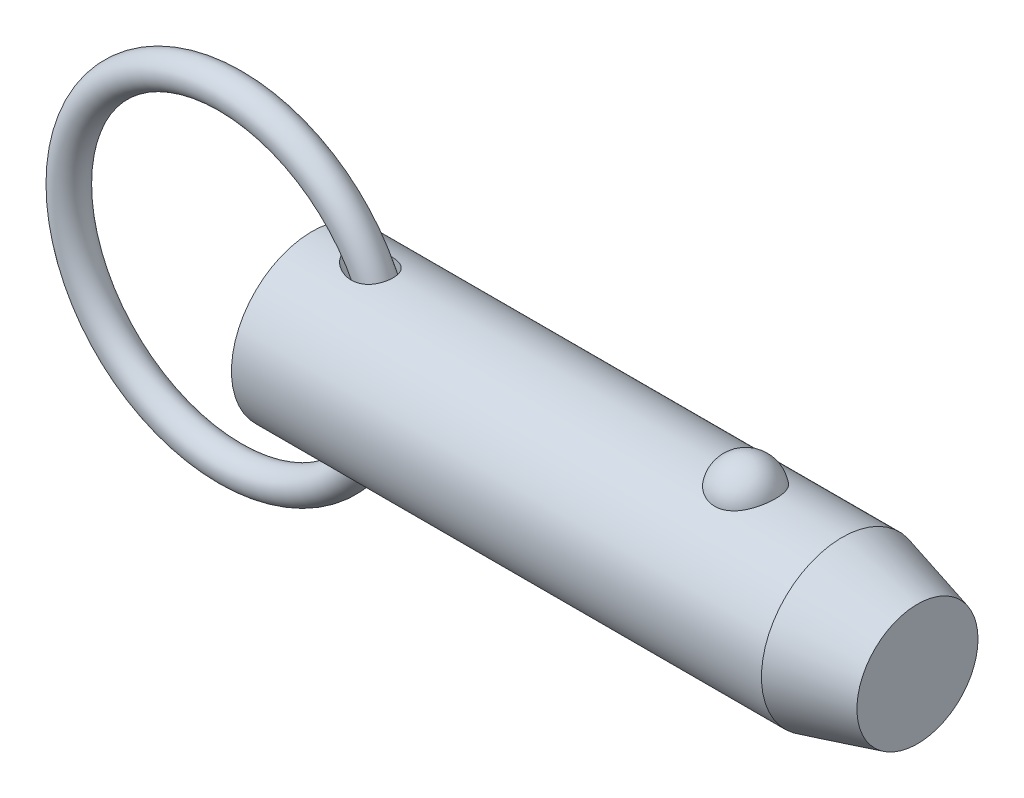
ISO-10303-21;
HEADER;
FILE_DESCRIPTION(('STEP AP214'),'2;1');
FILE_NAME('part.step','',(''),(''),'','','');
FILE_SCHEMA(('AUTOMOTIVE_DESIGN { 1 0 10303 214 1 1 1 1 }'));
ENDSEC;
DATA;
#1=APPLICATION_CONTEXT('core data for automotive mechanical design processes');
#2=APPLICATION_PROTOCOL_DEFINITION('international standard','automotive_design',2000,#1);
#3=PRODUCT_CONTEXT('',#1,'mechanical');
#4=PRODUCT('Part','Part','',(#3));
#5=PRODUCT_RELATED_PRODUCT_CATEGORY('part','',(#4));
#6=PRODUCT_DEFINITION_FORMATION('','',#4);
#7=PRODUCT_DEFINITION_CONTEXT('part definition',#1,'design');
#8=PRODUCT_DEFINITION('design','',#6,#7);
#9=PRODUCT_DEFINITION_SHAPE('','',#8);
#10=(LENGTH_UNIT() NAMED_UNIT(*) SI_UNIT(.MILLI.,.METRE.));
#11=(NAMED_UNIT(*) PLANE_ANGLE_UNIT() SI_UNIT($,.RADIAN.));
#12=(NAMED_UNIT(*) SI_UNIT($,.STERADIAN.) SOLID_ANGLE_UNIT());
#13=UNCERTAINTY_MEASURE_WITH_UNIT(LENGTH_MEASURE(1.E-05),#10,'distance_accuracy_value','');
#14=(GEOMETRIC_REPRESENTATION_CONTEXT(3) GLOBAL_UNCERTAINTY_ASSIGNED_CONTEXT((#13)) GLOBAL_UNIT_ASSIGNED_CONTEXT((#10,
#11,#12)) REPRESENTATION_CONTEXT('',''));
#15=CARTESIAN_POINT('',(0.,0.,0.));
#16=DIRECTION('',(0.,0.,1.));
#17=DIRECTION('',(1.,0.,0.));
#18=AXIS2_PLACEMENT_3D('',#15,#16,#17);
#19=CARTESIAN_POINT('',(-9.66825126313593,0.,0.));
#20=DIRECTION('',(0.,0.,1.));
#21=DIRECTION('',(1.,0.,0.));
#22=AXIS2_PLACEMENT_3D('',#19,#20,#21);
#23=TOROIDAL_SURFACE('',#22,19.05,1.905);
#24=CARTESIAN_POINT('',(11.2867487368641,0.,0.));
#25=VERTEX_POINT('',#24);
#26=VERTEX_LOOP('',#25);
#27=FACE_BOUND('',#26,.T.);
#28=ADVANCED_FACE('P0_F12',(#27),#23,.T.);
#29=CLOSED_SHELL('',(#28));
#30=MANIFOLD_SOLID_BREP('P0_B1',#29);
#31=CARTESIAN_POINT('',(0.,0.,0.));
#32=DIRECTION('',(1.,0.,0.));
#33=DIRECTION('',(0.,0.,-1.));
#34=AXIS2_PLACEMENT_3D('',#31,#32,#33);
#35=CYLINDRICAL_SURFACE('',#34,9.525);
#36=CARTESIAN_POINT('',(4.56693409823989,9.4314194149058,-1.33189820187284));
#37=CARTESIAN_POINT('',(4.70260475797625,9.41020313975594,-1.48215931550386));
#38=CARTESIAN_POINT('',(4.85555680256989,9.38755003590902,-1.61683982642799));
#39=CARTESIAN_POINT('',(5.10171959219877,9.35450554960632,-1.79512943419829));
#40=CARTESIAN_POINT('',(5.18674514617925,9.34362629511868,-1.85068909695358));
#41=CARTESIAN_POINT('',(5.3615438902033,9.32258514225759,-1.95392002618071));
#42=CARTESIAN_POINT('',(5.45131542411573,9.31242299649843,-2.00159402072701));
#43=CARTESIAN_POINT('',(5.70070211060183,9.28632120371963,-2.12033289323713));
#44=CARTESIAN_POINT('',(5.86420408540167,9.27146938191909,-2.18362944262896));
#45=CARTESIAN_POINT('',(6.19893345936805,9.24694163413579,-2.28525783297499));
#46=CARTESIAN_POINT('',(6.3701538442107,9.23726110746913,-2.32361187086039));
#47=CARTESIAN_POINT('',(6.73531776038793,9.22400982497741,-2.37575048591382));
#48=CARTESIAN_POINT('',(6.92975826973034,9.22118808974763,-2.38652934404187));
#49=CARTESIAN_POINT('',(7.21995443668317,9.22416297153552,-2.37494980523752));
#50=CARTESIAN_POINT('',(7.31643847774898,9.22635560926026,-2.366466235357));
#51=CARTESIAN_POINT('',(7.50796421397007,9.2331428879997,-2.33985028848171));
#52=CARTESIAN_POINT('',(7.60300650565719,9.23773650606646,-2.32172202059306));
#53=CARTESIAN_POINT('',(7.83273114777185,9.25183311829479,-2.26504721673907));
#54=CARTESIAN_POINT('',(7.96603028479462,9.26261470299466,-2.2209856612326));
#55=CARTESIAN_POINT('',(8.22310899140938,9.28816519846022,-2.1115730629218));
#56=CARTESIAN_POINT('',(8.34689477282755,9.30293147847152,-2.04623606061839));
#57=CARTESIAN_POINT('',(8.58136049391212,9.3349416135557,-1.89485344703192));
#58=CARTESIAN_POINT('',(8.69199721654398,9.35219324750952,-1.8087422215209));
#59=CARTESIAN_POINT('',(8.89592093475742,9.38707016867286,-1.6179918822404));
#60=CARTESIAN_POINT('',(8.98920771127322,9.40469546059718,-1.51335253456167));
#61=CARTESIAN_POINT('',(9.15057731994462,9.43713590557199,-1.29519427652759));
#62=CARTESIAN_POINT('',(9.21980158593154,9.45205440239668,-1.18253282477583));
#63=CARTESIAN_POINT('',(9.33826736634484,9.47856708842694,-0.946802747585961));
#64=CARTESIAN_POINT('',(9.38751161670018,9.49016173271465,-0.823735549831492));
#65=CARTESIAN_POINT('',(9.46423850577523,9.50859378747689,-0.572614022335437));
#66=CARTESIAN_POINT('',(9.4920239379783,9.5154972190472,-0.444656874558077));
#67=CARTESIAN_POINT('',(9.52636926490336,9.5240690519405,-0.185752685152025));
#68=CARTESIAN_POINT('',(9.53292923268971,9.52573747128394,-0.054805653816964));
#69=CARTESIAN_POINT('',(9.52467276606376,9.52365852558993,0.206503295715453));
#70=CARTESIAN_POINT('',(9.50983454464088,9.51990564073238,0.336864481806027));
#71=CARTESIAN_POINT('',(9.45907362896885,9.50737852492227,0.593166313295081));
#72=CARTESIAN_POINT('',(9.42315106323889,9.49860432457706,0.719106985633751));
#73=CARTESIAN_POINT('',(9.3310664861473,9.4769892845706,0.962959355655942));
#74=CARTESIAN_POINT('',(9.27490839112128,9.46414923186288,1.08087260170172));
#75=CARTESIAN_POINT('',(9.14375803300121,9.43581000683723,1.30534632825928));
#76=CARTESIAN_POINT('',(9.06876720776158,9.42031103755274,1.41190767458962));
#77=CARTESIAN_POINT('',(8.90203187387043,9.38836719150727,1.61069439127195));
#78=CARTESIAN_POINT('',(8.81029913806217,9.371922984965,1.70292975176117));
#79=CARTESIAN_POINT('',(8.61268775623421,9.33985045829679,1.87086859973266));
#80=CARTESIAN_POINT('',(8.50680947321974,9.3242221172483,1.94657251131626));
#81=CARTESIAN_POINT('',(8.28220546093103,9.29513431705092,2.08109032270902));
#82=CARTESIAN_POINT('',(8.16329919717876,9.28171415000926,2.13961034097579));
#83=CARTESIAN_POINT('',(7.91756052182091,9.25859072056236,2.23755716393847));
#84=CARTESIAN_POINT('',(7.79072606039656,9.24888842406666,2.27697900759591));
#85=CARTESIAN_POINT('',(7.52377913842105,9.23338749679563,2.33907806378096));
#86=CARTESIAN_POINT('',(7.3833476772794,9.22789571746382,2.36044900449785));
#87=CARTESIAN_POINT('',(7.1008139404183,9.22210229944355,2.3829751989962));
#88=CARTESIAN_POINT('',(6.95871103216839,9.22180269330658,2.38412253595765));
#89=CARTESIAN_POINT('',(6.65642691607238,9.22632724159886,2.36656230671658));
#90=CARTESIAN_POINT('',(6.49641694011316,9.23185415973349,2.3451317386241));
#91=CARTESIAN_POINT('',(6.18115433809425,9.24811737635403,2.28014143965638));
#92=CARTESIAN_POINT('',(6.02590710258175,9.25885936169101,2.23655754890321));
#93=CARTESIAN_POINT('',(5.69904720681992,9.28624254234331,2.12025087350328));
#94=CARTESIAN_POINT('',(5.52873601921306,9.30354853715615,2.04400672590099));
#95=CARTESIAN_POINT('',(5.20289495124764,9.34106989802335,1.86504730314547));
#96=CARTESIAN_POINT('',(5.04735968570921,9.36128419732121,1.76234172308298));
#97=CARTESIAN_POINT('',(4.7928712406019,9.39697639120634,1.55895334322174));
#98=CARTESIAN_POINT('',(4.68938704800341,9.41240250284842,1.46392900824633));
#99=CARTESIAN_POINT('',(4.49847141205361,9.44202586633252,1.25875918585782));
#100=CARTESIAN_POINT('',(4.41101129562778,9.45622528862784,1.1486413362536));
#101=CARTESIAN_POINT('',(4.27502257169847,9.47888210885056,0.94060098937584));
#102=CARTESIAN_POINT('',(4.22216329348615,9.48791121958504,0.845586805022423));
#103=CARTESIAN_POINT('',(4.1324147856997,9.50344321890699,0.648051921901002));
#104=CARTESIAN_POINT('',(4.0955118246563,9.50994827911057,0.545537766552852));
#105=CARTESIAN_POINT('',(4.04043124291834,9.51971586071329,0.334452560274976));
#106=CARTESIAN_POINT('',(4.02240728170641,9.52295176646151,0.225839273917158));
#107=CARTESIAN_POINT('',(4.00750873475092,9.52562364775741,0.00713006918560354));
#108=CARTESIAN_POINT('',(4.01062334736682,9.52506156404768,-0.102965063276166));
#109=CARTESIAN_POINT('',(4.03592967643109,9.52053221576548,-0.306944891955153));
#110=CARTESIAN_POINT('',(4.05571676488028,9.51699426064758,-0.401151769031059));
#111=CARTESIAN_POINT('',(4.10967975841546,9.5074546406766,-0.585176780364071));
#112=CARTESIAN_POINT('',(4.1438599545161,9.50145224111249,-0.674993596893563));
#113=CARTESIAN_POINT('',(4.23261356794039,9.48611703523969,-0.866116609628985));
#114=CARTESIAN_POINT('',(4.28990016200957,9.47635800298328,-0.966121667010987));
#115=CARTESIAN_POINT('',(4.4185657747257,9.45502867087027,-1.15640011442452));
#116=CARTESIAN_POINT('',(4.4899691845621,9.44345524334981,-1.24665623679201));
#117=CARTESIAN_POINT('',(4.56693409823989,9.4314194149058,-1.33189820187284));
#118=B_SPLINE_CURVE_WITH_KNOTS('',3,(#36,#37,#38,#39,#40,#41,#42,#43,#44,#45,#46,#47,#48,#49,
#50,#51,#52,#53,#54,#55,#56,#57,#58,#59,#60,#61,#62,#63,#64,#65,#66,#67,#68,#69,#70,#71,#72,#73,
#74,#75,#76,#77,#78,#79,#80,#81,#82,#83,#84,#85,#86,#87,#88,#89,#90,#91,#92,#93,#94,#95,#96,#97,
#98,#99,#100,#101,#102,#103,#104,#105,#106,#107,#108,#109,#110,#111,#112,#113,#114,#115,#116,
#117),.UNSPECIFIED.,.T.,.F.,(4,2,2,2,2,2,2,2,2,2,2,2,2,2,2,2,2,2,2,2,2,2,2,2,2,2,2,2,2,2,2,2,2,
2,2,2,2,2,2,2,4),(0.,0.609951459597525,0.916123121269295,1.22218863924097,1.74791337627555,
2.27316961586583,2.85362722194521,3.14383229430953,3.43391382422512,3.85437497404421,
4.27455920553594,4.69608835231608,5.11762282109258,5.51490051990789,5.91212379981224,
6.30363414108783,6.69514313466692,7.0870510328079,7.47895654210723,7.87078624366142,
8.26258603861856,8.65411137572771,9.0456266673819,9.44349251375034,9.84146165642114,
10.2662286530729,10.6911619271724,11.1739180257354,11.6572017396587,12.2170157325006,
12.776624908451,13.1992556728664,13.6211226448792,13.9471990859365,14.2729943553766,
14.6014211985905,14.9296802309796,15.2173810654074,15.505167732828,15.8505863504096,
16.1966070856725),.UNSPECIFIED.);
#119=CARTESIAN_POINT('',(4.56693409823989,9.4314194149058,-1.33189820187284));
#120=VERTEX_POINT('',#119);
#121=EDGE_CURVE('P1_E40',#120,#120,#118,.T.);
#122=ORIENTED_EDGE('',*,*,#121,.T.);
#123=EDGE_LOOP('',(#122));
#124=FACE_BOUND('',#123,.T.);
#125=CARTESIAN_POINT('',(62.5430540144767,0.,0.));
#126=DIRECTION('',(1.,0.,0.));
#127=DIRECTION('',(0.,0.,-1.));
#128=AXIS2_PLACEMENT_3D('',#125,#126,#127);
#129=CIRCLE('',#128,9.525);
#130=CARTESIAN_POINT('',(62.5430540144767,0.,-9.525));
#131=VERTEX_POINT('',#130);
#132=EDGE_CURVE('P1_E25',#131,#131,#129,.T.);
#133=ORIENTED_EDGE('',*,*,#132,.F.);
#134=EDGE_LOOP('',(#133));
#135=FACE_BOUND('',#134,.T.);
#136=CARTESIAN_POINT('',(0.,0.,0.));
#137=DIRECTION('',(1.,0.,0.));
#138=DIRECTION('',(0.,0.,-1.));
#139=AXIS2_PLACEMENT_3D('',#136,#137,#138);
#140=CIRCLE('',#139,9.525);
#141=CARTESIAN_POINT('',(0.,0.,-9.525));
#142=VERTEX_POINT('',#141);
#143=EDGE_CURVE('P1_E9',#142,#142,#140,.T.);
#144=ORIENTED_EDGE('',*,*,#143,.T.);
#145=EDGE_LOOP('',(#144));
#146=FACE_BOUND('',#145,.T.);
#147=CARTESIAN_POINT('',(51.1457573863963,8.80405803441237,3.63513233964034));
#148=CARTESIAN_POINT('',(51.0516766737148,8.80405953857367,3.63513053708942));
#149=CARTESIAN_POINT('',(50.9575618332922,8.80561325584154,3.63137461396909));
#150=CARTESIAN_POINT('',(50.7700126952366,8.81177748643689,3.61638665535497));
#151=CARTESIAN_POINT('',(50.6765788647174,8.81638992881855,3.60514990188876));
#152=CARTESIAN_POINT('',(50.3979452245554,8.8346711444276,3.56024627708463));
#153=CARTESIAN_POINT('',(50.2146916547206,8.85278327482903,3.51538626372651));
#154=CARTESIAN_POINT('',(49.859509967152,8.89871214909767,3.39742145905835));
#155=CARTESIAN_POINT('',(49.6875533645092,8.92650327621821,3.32439116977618));
#156=CARTESIAN_POINT('',(49.358707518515,8.98874819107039,3.15220244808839));
#157=CARTESIAN_POINT('',(49.2018114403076,9.02319893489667,3.05305594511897));
#158=CARTESIAN_POINT('',(48.9022147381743,9.09629186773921,2.82797815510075));
#159=CARTESIAN_POINT('',(48.7600600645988,9.13502685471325,2.70135138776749));
#160=CARTESIAN_POINT('',(48.4982999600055,9.2118657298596,2.42641932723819));
#161=CARTESIAN_POINT('',(48.3787015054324,9.24996941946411,2.27810735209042));
#162=CARTESIAN_POINT('',(48.159645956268,9.32341082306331,1.95652290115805));
#163=CARTESIAN_POINT('',(48.0613174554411,9.35855090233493,1.78243511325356));
#164=CARTESIAN_POINT('',(47.8938190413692,9.42045142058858,1.41937246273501));
#165=CARTESIAN_POINT('',(47.8246511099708,9.44721128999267,1.23039658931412));
#166=CARTESIAN_POINT('',(47.7161994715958,9.48990641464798,0.84037088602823));
#167=CARTESIAN_POINT('',(47.6772880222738,9.50570658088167,0.639202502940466));
#168=CARTESIAN_POINT('',(47.6315550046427,9.52433146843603,0.232664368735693));
#169=CARTESIAN_POINT('',(47.6247324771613,9.52715657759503,0.0272947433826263));
#170=CARTESIAN_POINT('',(47.643255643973,9.51956918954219,-0.380478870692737));
#171=CARTESIAN_POINT('',(47.6684052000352,9.50923740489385,-0.58289331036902));
#172=CARTESIAN_POINT('',(47.75002537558,9.47651897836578,-0.980293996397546));
#173=CARTESIAN_POINT('',(47.8064966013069,9.45413210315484,-1.17528009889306));
#174=CARTESIAN_POINT('',(47.9497192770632,9.39954044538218,-1.55263697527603));
#175=CARTESIAN_POINT('',(48.0365124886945,9.36732213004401,-1.73498993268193));
#176=CARTESIAN_POINT('',(48.2386103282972,9.29640700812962,-2.08177763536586));
#177=CARTESIAN_POINT('',(48.3539172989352,9.25770966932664,-2.24621090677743));
#178=CARTESIAN_POINT('',(48.611264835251,9.17775604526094,-2.5533833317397));
#179=CARTESIAN_POINT('',(48.7534344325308,9.136488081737,-2.696011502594));
#180=CARTESIAN_POINT('',(49.06089985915,9.05620497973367,-2.95451229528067));
#181=CARTESIAN_POINT('',(49.226193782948,9.01718965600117,-3.07038711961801));
#182=CARTESIAN_POINT('',(49.572052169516,8.94680019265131,-3.26976836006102));
#183=CARTESIAN_POINT('',(49.7522278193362,8.91528408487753,-3.353897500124));
#184=CARTESIAN_POINT('',(50.1256514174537,8.86272514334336,-3.49043503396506));
#185=CARTESIAN_POINT('',(50.3188944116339,8.84167836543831,-3.54285537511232));
#186=CARTESIAN_POINT('',(50.7025036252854,8.81348056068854,-3.61241306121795));
#187=CARTESIAN_POINT('',(50.8925251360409,8.80568348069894,-3.63119339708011));
#188=CARTESIAN_POINT('',(51.2731906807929,8.80289410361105,-3.63795342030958));
#189=CARTESIAN_POINT('',(51.4638345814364,8.80789922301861,-3.62593932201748));
#190=CARTESIAN_POINT('',(51.834007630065,8.82974915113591,-3.57238430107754));
#191=CARTESIAN_POINT('',(52.0136976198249,8.84621463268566,-3.53178890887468));
#192=CARTESIAN_POINT('',(52.3634226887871,8.88875330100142,-3.42331083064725));
#193=CARTESIAN_POINT('',(52.5334569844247,8.91482726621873,-3.35542593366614));
#194=CARTESIAN_POINT('',(52.8632377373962,8.97448239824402,-3.19248225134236));
#195=CARTESIAN_POINT('',(53.0226801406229,9.00821446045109,-3.09686474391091));
#196=CARTESIAN_POINT('',(53.3235136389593,9.07935398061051,-2.88162736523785));
#197=CARTESIAN_POINT('',(53.4649005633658,9.11676228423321,-2.76200196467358));
#198=CARTESIAN_POINT('',(53.7333193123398,9.19347419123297,-2.49516285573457));
#199=CARTESIAN_POINT('',(53.8592750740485,9.23277872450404,-2.34686614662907));
#200=CARTESIAN_POINT('',(54.0855227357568,9.30737610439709,-2.03093683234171));
#201=CARTESIAN_POINT('',(54.1858100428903,9.34266823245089,-1.86330077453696));
#202=CARTESIAN_POINT('',(54.3615149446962,9.40674710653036,-1.50744893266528));
#203=CARTESIAN_POINT('',(54.436041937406,9.43529176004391,-1.31874876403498));
#204=CARTESIAN_POINT('',(54.5541650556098,9.48144132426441,-0.930631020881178));
#205=CARTESIAN_POINT('',(54.5977608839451,9.49904612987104,-0.731213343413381));
#206=CARTESIAN_POINT('',(54.6531580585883,9.5215314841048,-0.32714729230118));
#207=CARTESIAN_POINT('',(54.6649354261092,9.52640243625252,-0.122495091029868));
#208=CARTESIAN_POINT('',(54.6563825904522,9.5228957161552,0.286018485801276));
#209=CARTESIAN_POINT('',(54.6360530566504,9.5145183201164,0.489879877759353));
#210=CARTESIAN_POINT('',(54.5638840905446,9.48544083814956,0.889994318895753));
#211=CARTESIAN_POINT('',(54.5121993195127,9.46480124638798,1.08627971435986));
#212=CARTESIAN_POINT('',(54.3784917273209,9.4133389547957,1.46682086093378));
#213=CARTESIAN_POINT('',(54.2964668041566,9.38251554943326,1.65107577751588));
#214=CARTESIAN_POINT('',(54.1031929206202,9.31365636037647,2.00346348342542));
#215=CARTESIAN_POINT('',(53.9917838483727,9.27558138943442,2.17150083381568));
#216=CARTESIAN_POINT('',(53.7422947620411,9.19638714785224,2.48563115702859));
#217=CARTESIAN_POINT('',(53.6042163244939,9.15526805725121,2.63172542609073));
#218=CARTESIAN_POINT('',(53.3048438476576,9.07465393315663,2.89750997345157));
#219=CARTESIAN_POINT('',(53.1436109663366,9.03515496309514,3.01726776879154));
#220=CARTESIAN_POINT('',(52.8016136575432,8.96227564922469,3.22732920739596));
#221=CARTESIAN_POINT('',(52.620841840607,8.92889763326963,3.31762165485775));
#222=CARTESIAN_POINT('',(52.2514451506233,8.8734538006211,3.46314419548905));
#223=CARTESIAN_POINT('',(52.0633237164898,8.85102983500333,3.51950082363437));
#224=CARTESIAN_POINT('',(51.7757869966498,8.8266696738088,3.57993683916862));
#225=CARTESIAN_POINT('',(51.6791339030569,8.82009725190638,3.5960621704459));
#226=CARTESIAN_POINT('',(51.4846770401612,8.81020897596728,3.62022512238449));
#227=CARTESIAN_POINT('',(51.3868741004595,8.80689090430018,3.62826825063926));
#228=CARTESIAN_POINT('',(51.2412243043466,8.80445615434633,3.63416760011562));
#229=CARTESIAN_POINT('',(51.1934952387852,8.80405727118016,3.63513325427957));
#230=CARTESIAN_POINT('',(51.1457573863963,8.80405803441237,3.63513233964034));
#231=B_SPLINE_CURVE_WITH_KNOTS('',3,(#147,#148,#149,#150,#151,#152,#153,#154,#155,#156,#157,
#158,#159,#160,#161,#162,#163,#164,#165,#166,#167,#168,#169,#170,#171,#172,#173,#174,#175,#176,
#177,#178,#179,#180,#181,#182,#183,#184,#185,#186,#187,#188,#189,#190,#191,#192,#193,#194,#195,
#196,#197,#198,#199,#200,#201,#202,#203,#204,#205,#206,#207,#208,#209,#210,#211,#212,#213,#214,
#215,#216,#217,#218,#219,#220,#221,#222,#223,#224,#225,#226,#227,#228,#229,#230),.UNSPECIFIED.,
.T.,.F.,(4,2,2,2,2,2,2,2,2,2,2,2,2,2,2,2,2,2,2,2,2,2,2,2,2,2,2,2,2,2,2,2,2,2,2,2,2,2,2,2,2,4),
(0.,0.282202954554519,0.564584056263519,1.13017050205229,1.69427128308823,2.25811483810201,
2.83836627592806,3.41879688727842,4.02497117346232,4.63118665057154,5.24474754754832,
5.85829010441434,6.46808687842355,7.07789545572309,7.68854723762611,8.29924920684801,
8.91296283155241,9.52662591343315,10.1275338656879,10.7282152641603,11.2986646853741,
11.868998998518,12.4213015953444,12.973648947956,13.5380053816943,14.1024919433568,
14.695298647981,15.2882113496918,15.8999469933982,16.5116885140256,17.1238909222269,
17.7360805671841,18.3452748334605,18.9545113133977,19.567138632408,20.179729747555,
20.7907316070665,21.4019653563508,21.9915938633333,22.2859053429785,22.5800161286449,
22.723209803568),.UNSPECIFIED.);
#232=CARTESIAN_POINT('',(51.1457573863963,8.80405803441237,3.63513233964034));
#233=VERTEX_POINT('',#232);
#234=EDGE_CURVE('P1_E34',#233,#233,#231,.T.);
#235=ORIENTED_EDGE('',*,*,#234,.T.);
#236=EDGE_LOOP('',(#235));
#237=FACE_BOUND('',#236,.T.);
#238=CARTESIAN_POINT('',(4.56693409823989,-9.4314194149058,-1.33189820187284));
#239=CARTESIAN_POINT('',(4.48932984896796,-9.4435553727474,-1.24594548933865));
#240=CARTESIAN_POINT('',(4.41737309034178,-9.45522193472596,-1.1548795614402));
#241=CARTESIAN_POINT('',(4.28781047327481,-9.47670896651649,-0.962782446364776));
#242=CARTESIAN_POINT('',(4.23019403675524,-9.48653079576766,-0.861758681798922));
#243=CARTESIAN_POINT('',(4.132545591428,-9.5034118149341,-0.649723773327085));
#244=CARTESIAN_POINT('',(4.09271158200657,-9.51043980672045,-0.538615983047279));
#245=CARTESIAN_POINT('',(4.04973167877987,-9.51806966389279,-0.367764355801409));
#246=CARTESIAN_POINT('',(4.03820037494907,-9.52012756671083,-0.310118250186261));
#247=CARTESIAN_POINT('',(4.02100287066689,-9.52320274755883,-0.193935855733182));
#248=CARTESIAN_POINT('',(4.0153356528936,-9.52422020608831,-0.135399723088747));
#249=CARTESIAN_POINT('',(4.0081707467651,-9.52550497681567,0.0247266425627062));
#250=CARTESIAN_POINT('',(4.0127049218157,-9.52468821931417,0.126661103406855));
#251=CARTESIAN_POINT('',(4.03954973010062,-9.51988506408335,0.328012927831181));
#252=CARTESIAN_POINT('',(4.06186450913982,-9.51589792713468,0.427429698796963));
#253=CARTESIAN_POINT('',(4.12088980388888,-9.50548528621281,0.616362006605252));
#254=CARTESIAN_POINT('',(4.15684838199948,-9.49918763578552,0.706123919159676));
#255=CARTESIAN_POINT('',(4.24094647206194,-9.48470618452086,0.879522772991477));
#256=CARTESIAN_POINT('',(4.28909090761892,-9.47652162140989,0.963157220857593));
#257=CARTESIAN_POINT('',(4.42295891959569,-9.45426317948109,1.16513741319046));
#258=CARTESIAN_POINT('',(4.51523752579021,-9.43933320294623,1.27905352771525));
#259=CARTESIAN_POINT('',(4.71682295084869,-9.40825940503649,1.49055892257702));
#260=CARTESIAN_POINT('',(4.82617286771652,-9.39211256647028,1.58810554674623));
#261=CARTESIAN_POINT('',(5.09064226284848,-9.35555264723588,1.79246125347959));
#262=CARTESIAN_POINT('',(5.2499041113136,-9.33524115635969,1.89393122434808));
#263=CARTESIAN_POINT('',(5.58309255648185,-9.29785396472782,2.06968659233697));
#264=CARTESIAN_POINT('',(5.75702897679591,-9.28078045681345,2.14395359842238));
#265=CARTESIAN_POINT('',(6.11646882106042,-9.25213303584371,2.26440412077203));
#266=CARTESIAN_POINT('',(6.30205582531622,-9.2406056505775,2.31035092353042));
#267=CARTESIAN_POINT('',(6.67856093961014,-9.22541807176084,2.37029728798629));
#268=CARTESIAN_POINT('',(6.86947045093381,-9.2217458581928,2.3843456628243));
#269=CARTESIAN_POINT('',(7.21217144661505,-9.2234423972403,2.37775005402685));
#270=CARTESIAN_POINT('',(7.36409439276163,-9.22713860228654,2.36352577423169));
#271=CARTESIAN_POINT('',(7.66346227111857,-9.24048072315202,2.31082299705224));
#272=CARTESIAN_POINT('',(7.81090958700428,-9.25012341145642,2.27235765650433));
#273=CARTESIAN_POINT('',(8.09730316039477,-9.2746609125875,2.17003648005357));
#274=CARTESIAN_POINT('',(8.23619652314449,-9.28958517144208,2.10603803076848));
#275=CARTESIAN_POINT('',(8.49918675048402,-9.32290326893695,1.95324442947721));
#276=CARTESIAN_POINT('',(8.62328895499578,-9.34129584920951,1.86445826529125));
#277=CARTESIAN_POINT('',(8.84006515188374,-9.37706953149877,1.67466761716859));
#278=CARTESIAN_POINT('',(8.93465172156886,-9.39436331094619,1.57582357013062));
#279=CARTESIAN_POINT('',(9.10490234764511,-9.42761680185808,1.362809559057));
#280=CARTESIAN_POINT('',(9.18057146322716,-9.44357686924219,1.24864370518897));
#281=CARTESIAN_POINT('',(9.30789178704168,-9.47159985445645,1.01379272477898));
#282=CARTESIAN_POINT('',(9.36045544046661,-9.48380365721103,0.893617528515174));
#283=CARTESIAN_POINT('',(9.44498362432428,-9.50388751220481,0.645890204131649));
#284=CARTESIAN_POINT('',(9.47694947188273,-9.51176784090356,0.518338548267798));
#285=CARTESIAN_POINT('',(9.51944262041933,-9.52232073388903,0.260103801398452));
#286=CARTESIAN_POINT('',(9.53006646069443,-9.52501674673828,0.129437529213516));
#287=CARTESIAN_POINT('',(9.52993291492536,-9.52498309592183,-0.131885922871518));
#288=CARTESIAN_POINT('',(9.5191752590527,-9.52225336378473,-0.262543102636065));
#289=CARTESIAN_POINT('',(9.47648788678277,-9.51165418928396,-0.520312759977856));
#290=CARTESIAN_POINT('',(9.44453086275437,-9.50377811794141,-0.647420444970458));
#291=CARTESIAN_POINT('',(9.36015568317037,-9.48373425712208,-0.894290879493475));
#292=CARTESIAN_POINT('',(9.30773827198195,-9.47156662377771,-1.01405389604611));
#293=CARTESIAN_POINT('',(9.1838089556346,-9.44428888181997,-1.24269386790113));
#294=CARTESIAN_POINT('',(9.11232064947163,-9.42918241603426,-1.35158405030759));
#295=CARTESIAN_POINT('',(8.9521268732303,-9.39767706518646,-1.55562459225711));
#296=CARTESIAN_POINT('',(8.86342281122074,-9.3812782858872,-1.65077607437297));
#297=CARTESIAN_POINT('',(8.67104443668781,-9.34891827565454,-1.8251751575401));
#298=CARTESIAN_POINT('',(8.56732858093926,-9.33295841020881,-1.90437711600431));
#299=CARTESIAN_POINT('',(8.3481843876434,-9.30317889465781,-2.0449122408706));
#300=CARTESIAN_POINT('',(8.23275529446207,-9.28935938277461,-2.10624425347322));
#301=CARTESIAN_POINT('',(7.98961240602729,-9.26475003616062,-2.2120340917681));
#302=CARTESIAN_POINT('',(7.86162088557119,-9.25407358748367,-2.25587700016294));
#303=CARTESIAN_POINT('',(7.60027499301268,-9.23720810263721,-2.32397032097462));
#304=CARTESIAN_POINT('',(7.46691858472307,-9.23102078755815,-2.34821321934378));
#305=CARTESIAN_POINT('',(7.18516230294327,-9.22302718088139,-2.37943079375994));
#306=CARTESIAN_POINT('',(7.03654454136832,-9.22169704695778,-2.38452997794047));
#307=CARTESIAN_POINT('',(6.74015049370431,-9.22442327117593,-2.37395141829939));
#308=CARTESIAN_POINT('',(6.59237455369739,-9.22848170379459,-2.35826567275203));
#309=CARTESIAN_POINT('',(6.27762777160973,-9.2422287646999,-2.30385559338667));
#310=CARTESIAN_POINT('',(6.11124715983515,-9.25269504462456,-2.26192683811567));
#311=CARTESIAN_POINT('',(5.78635920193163,-9.27830776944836,-2.15445569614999));
#312=CARTESIAN_POINT('',(5.62786567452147,-9.29346211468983,-2.08887341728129));
#313=CARTESIAN_POINT('',(5.39013065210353,-9.31931237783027,-1.96924953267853));
#314=CARTESIAN_POINT('',(5.30683088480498,-9.32901725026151,-1.92292485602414));
#315=CARTESIAN_POINT('',(5.14455801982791,-9.34899035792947,-1.82334419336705));
#316=CARTESIAN_POINT('',(5.06558607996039,-9.35925874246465,-1.77008636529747));
#317=CARTESIAN_POINT('',(4.83670950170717,-9.39034445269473,-1.60010986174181));
#318=CARTESIAN_POINT('',(4.69422471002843,-9.41151337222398,-1.47288240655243));
#319=CARTESIAN_POINT('',(4.56693409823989,-9.4314194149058,-1.33189820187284));
#320=B_SPLINE_CURVE_WITH_KNOTS('',3,(#238,#239,#240,#241,#242,#243,#244,#245,#246,#247,#248,
#249,#250,#251,#252,#253,#254,#255,#256,#257,#258,#259,#260,#261,#262,#263,#264,#265,#266,#267,
#268,#269,#270,#271,#272,#273,#274,#275,#276,#277,#278,#279,#280,#281,#282,#283,#284,#285,#286,
#287,#288,#289,#290,#291,#292,#293,#294,#295,#296,#297,#298,#299,#300,#301,#302,#303,#304,#305,
#306,#307,#308,#309,#310,#311,#312,#313,#314,#315,#316,#317,#318,#319),.UNSPECIFIED.,.T.,.F.,(4,
2,2,2,2,2,2,2,2,2,2,2,2,2,2,2,2,2,2,2,2,2,2,2,2,2,2,2,2,2,2,2,2,2,2,2,2,2,2,2,4),(0.,
0.348900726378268,0.697543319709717,1.0499765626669,1.22617690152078,1.40234666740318,
1.70666745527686,2.01105922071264,2.30066493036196,2.59038784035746,3.03001384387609,
3.4707682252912,4.03766594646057,4.60494622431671,5.17690598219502,5.74798989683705,
6.20400848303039,6.65977977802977,7.11813321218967,7.57632066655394,7.98791759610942,
8.39940433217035,8.79273459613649,9.18603970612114,9.57756168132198,9.96908859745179,
10.3611208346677,10.7531388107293,11.1446739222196,11.536177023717,11.9287850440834,
12.3214184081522,12.7268448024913,13.1324265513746,13.5768390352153,14.0214226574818,
14.5351685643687,15.0497849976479,15.3368801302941,15.6240516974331,16.1963372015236),.UNSPECIFIED.);
#321=CARTESIAN_POINT('',(4.56693409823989,-9.4314194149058,-1.33189820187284));
#322=VERTEX_POINT('',#321);
#323=EDGE_CURVE('P1_E17',#322,#322,#320,.T.);
#324=ORIENTED_EDGE('',*,*,#323,.T.);
#325=EDGE_LOOP('',(#324));
#326=FACE_BOUND('',#325,.T.);
#327=ADVANCED_FACE('P1_F13',(#124,#135,#146,#237,#326),#35,.T.);
#328=CARTESIAN_POINT('',(0.,0.,0.));
#329=DIRECTION('',(-1.,0.,0.));
#330=DIRECTION('',(0.,0.,1.));
#331=AXIS2_PLACEMENT_3D('',#328,#329,#330);
#332=PLANE('',#331);
#333=ORIENTED_EDGE('',*,*,#143,.F.);
#334=EDGE_LOOP('',(#333));
#335=FACE_BOUND('',#334,.T.);
#336=ADVANCED_FACE('P1_F15',(#335),#332,.T.);
#337=CARTESIAN_POINT('',(71.43,0.,0.));
#338=DIRECTION('',(-1.,0.,0.));
#339=DIRECTION('',(0.,0.,1.));
#340=AXIS2_PLACEMENT_3D('',#337,#338,#339);
#341=CONICAL_SURFACE('',#340,7.14375000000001,0.26179938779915);
#342=ORIENTED_EDGE('',*,*,#132,.T.);
#343=EDGE_LOOP('',(#342));
#344=FACE_BOUND('',#343,.T.);
#345=CARTESIAN_POINT('',(71.43,0.,0.));
#346=DIRECTION('',(1.,0.,0.));
#347=DIRECTION('',(0.,0.,-1.));
#348=AXIS2_PLACEMENT_3D('',#345,#346,#347);
#349=CIRCLE('',#348,7.14375000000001);
#350=CARTESIAN_POINT('',(71.43,0.,-7.14375000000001));
#351=VERTEX_POINT('',#350);
#352=EDGE_CURVE('P1_E30',#351,#351,#349,.T.);
#353=ORIENTED_EDGE('',*,*,#352,.F.);
#354=EDGE_LOOP('',(#353));
#355=FACE_BOUND('',#354,.T.);
#356=ADVANCED_FACE('P1_F55',(#344,#355),#341,.T.);
#357=CARTESIAN_POINT('',(71.43,7.14375000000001,0.));
#358=DIRECTION('',(1.,0.,0.));
#359=DIRECTION('',(0.,0.,-1.));
#360=AXIS2_PLACEMENT_3D('',#357,#358,#359);
#361=PLANE('',#360);
#362=ORIENTED_EDGE('',*,*,#352,.T.);
#363=EDGE_LOOP('',(#362));
#364=FACE_BOUND('',#363,.T.);
#365=ADVANCED_FACE('P1_F51',(#364),#361,.T.);
#366=CARTESIAN_POINT('',(51.1457573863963,8.5725,0.));
#367=DIRECTION('',(-1.,0.,0.));
#368=DIRECTION('',(0.,1.,0.));
#369=AXIS2_PLACEMENT_3D('',#366,#367,#368);
#370=SPHERICAL_SURFACE('',#369,3.6425);
#371=ORIENTED_EDGE('',*,*,#234,.F.);
#372=EDGE_LOOP('',(#371));
#373=FACE_BOUND('',#372,.T.);
#374=ADVANCED_FACE('P1_F46',(#373),#370,.T.);
#375=CARTESIAN_POINT('',(-9.66825126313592,0.,0.));
#376=DIRECTION('',(0.,0.,1.));
#377=DIRECTION('',(1.,0.,0.));
#378=AXIS2_PLACEMENT_3D('',#375,#376,#377);
#379=TOROIDAL_SURFACE('',#378,19.05,2.38125);
#380=ORIENTED_EDGE('',*,*,#323,.F.);
#381=EDGE_LOOP('',(#380));
#382=FACE_BOUND('',#381,.T.);
#383=ORIENTED_EDGE('',*,*,#121,.F.);
#384=EDGE_LOOP('',(#383));
#385=FACE_BOUND('',#384,.T.);
#386=ADVANCED_FACE('P1_F50',(#382,#385),#379,.F.);
#387=CLOSED_SHELL('',(#327,#336,#356,#365,#374,#386));
#388=MANIFOLD_SOLID_BREP('P1_B1',#387);
#389=ADVANCED_BREP_SHAPE_REPRESENTATION('',(#18,#30,#388),#14);
#390=SHAPE_DEFINITION_REPRESENTATION(#9,#389);
ENDSEC;
END-ISO-10303-21;
